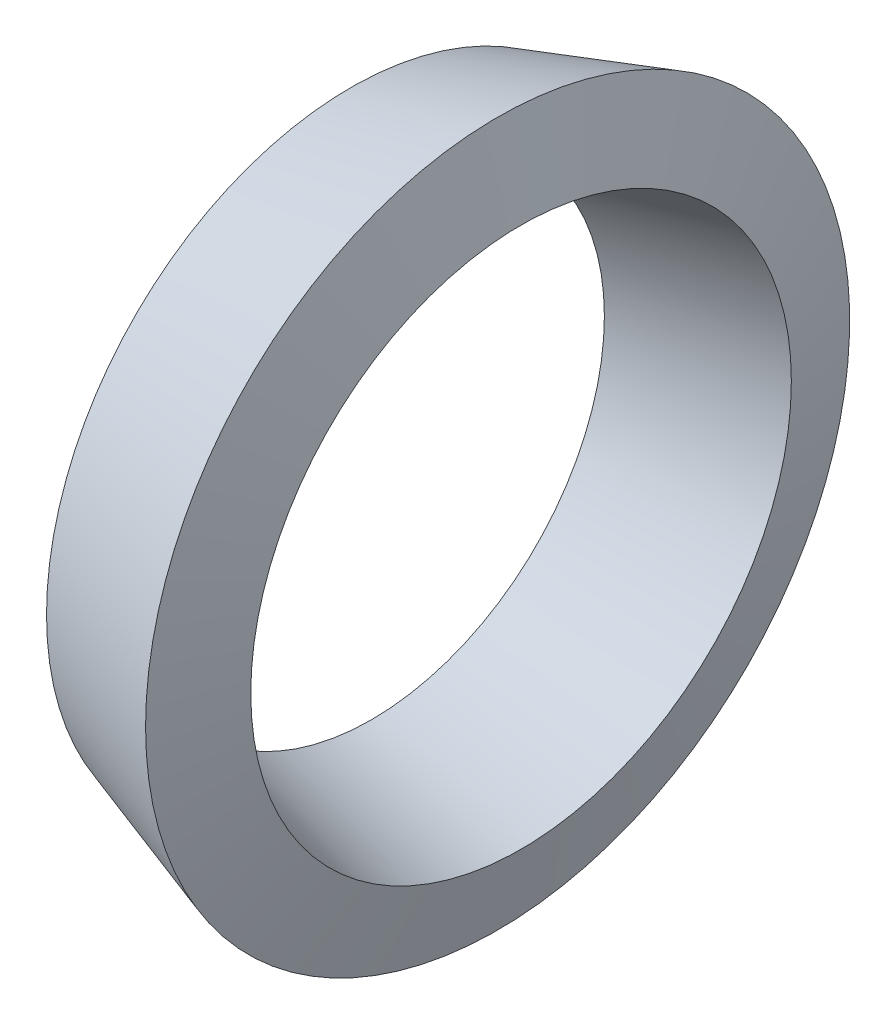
ISO-10303-21;
HEADER;
FILE_DESCRIPTION(('STEP AP214'),'2;1');
FILE_NAME('part.step','',(''),(''),'','','');
FILE_SCHEMA(('AUTOMOTIVE_DESIGN { 1 0 10303 214 1 1 1 1 }'));
ENDSEC;
DATA;
#1=APPLICATION_CONTEXT('core data for automotive mechanical design processes');
#2=APPLICATION_PROTOCOL_DEFINITION('international standard','automotive_design',2000,#1);
#3=PRODUCT_CONTEXT('',#1,'mechanical');
#4=PRODUCT('Part','Part','',(#3));
#5=PRODUCT_RELATED_PRODUCT_CATEGORY('part','',(#4));
#6=PRODUCT_DEFINITION_FORMATION('','',#4);
#7=PRODUCT_DEFINITION_CONTEXT('part definition',#1,'design');
#8=PRODUCT_DEFINITION('design','',#6,#7);
#9=PRODUCT_DEFINITION_SHAPE('','',#8);
#10=(LENGTH_UNIT() NAMED_UNIT(*) SI_UNIT(.MILLI.,.METRE.));
#11=(NAMED_UNIT(*) PLANE_ANGLE_UNIT() SI_UNIT($,.RADIAN.));
#12=(NAMED_UNIT(*) SI_UNIT($,.STERADIAN.) SOLID_ANGLE_UNIT());
#13=UNCERTAINTY_MEASURE_WITH_UNIT(LENGTH_MEASURE(1.E-05),#10,'distance_accuracy_value','');
#14=(GEOMETRIC_REPRESENTATION_CONTEXT(3) GLOBAL_UNCERTAINTY_ASSIGNED_CONTEXT((#13)) GLOBAL_UNIT_ASSIGNED_CONTEXT((#10,
#11,#12)) REPRESENTATION_CONTEXT('',''));
#15=CARTESIAN_POINT('',(0.,0.,0.));
#16=DIRECTION('',(0.,0.,1.));
#17=DIRECTION('',(1.,0.,0.));
#18=AXIS2_PLACEMENT_3D('',#15,#16,#17);
#19=CARTESIAN_POINT('',(0.60459968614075,0.,0.));
#20=DIRECTION('',(1.,0.,0.));
#21=DIRECTION('',(0.,0.,-1.));
#22=AXIS2_PLACEMENT_3D('',#19,#20,#21);
#23=CONICAL_SURFACE('',#22,18.8978460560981,0.314086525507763);
#24=CARTESIAN_POINT('',(9.71250197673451,0.,0.));
#25=DIRECTION('',(-1.,0.,0.));
#26=DIRECTION('',(0.,0.,1.));
#27=AXIS2_PLACEMENT_3D('',#24,#25,#26);
#28=CIRCLE('',#27,21.8564504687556);
#29=CARTESIAN_POINT('',(9.71250197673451,0.,21.8564504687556));
#30=VERTEX_POINT('',#29);
#31=EDGE_CURVE('E9',#30,#30,#28,.T.);
#32=ORIENTED_EDGE('',*,*,#31,.T.);
#33=EDGE_LOOP('',(#32));
#34=FACE_BOUND('',#33,.T.);
#35=CARTESIAN_POINT('',(0.60459968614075,0.,0.));
#36=DIRECTION('',(-1.,0.,0.));
#37=DIRECTION('',(0.,0.,1.));
#38=AXIS2_PLACEMENT_3D('',#35,#36,#37);
#39=CIRCLE('',#38,18.8978460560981);
#40=CARTESIAN_POINT('',(0.60459968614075,0.,18.8978460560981));
#41=VERTEX_POINT('',#40);
#42=EDGE_CURVE('E28',#41,#41,#39,.T.);
#43=ORIENTED_EDGE('',*,*,#42,.F.);
#44=EDGE_LOOP('',(#43));
#45=FACE_BOUND('',#44,.T.);
#46=ADVANCED_FACE('F14',(#34,#45),#23,.T.);
#47=CARTESIAN_POINT('',(11.1674980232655,0.,0.));
#48=DIRECTION('',(-1.,0.,0.));
#49=DIRECTION('',(0.,0.,1.));
#50=AXIS2_PLACEMENT_3D('',#47,#48,#49);
#51=CONICAL_SURFACE('',#50,16.7808828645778,1.29161638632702);
#52=ORIENTED_EDGE('',*,*,#31,.F.);
#53=EDGE_LOOP('',(#52));
#54=FACE_BOUND('',#53,.T.);
#55=CARTESIAN_POINT('',(11.1674980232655,0.,0.));
#56=DIRECTION('',(-1.,0.,0.));
#57=DIRECTION('',(0.,0.,1.));
#58=AXIS2_PLACEMENT_3D('',#55,#56,#57);
#59=CIRCLE('',#58,16.7808828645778);
#60=CARTESIAN_POINT('',(11.1674980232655,0.,16.7808828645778));
#61=VERTEX_POINT('',#60);
#62=EDGE_CURVE('E20',#61,#61,#59,.T.);
#63=ORIENTED_EDGE('',*,*,#62,.T.);
#64=EDGE_LOOP('',(#63));
#65=FACE_BOUND('',#64,.T.);
#66=ADVANCED_FACE('F37',(#54,#65),#51,.T.);
#67=CARTESIAN_POINT('',(1.87540031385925,0.,0.));
#68=DIRECTION('',(1.,0.,0.));
#69=DIRECTION('',(0.,0.,-1.));
#70=AXIS2_PLACEMENT_3D('',#67,#68,#69);
#71=CONICAL_SURFACE('',#70,14.4648206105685,0.24427335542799);
#72=ORIENTED_EDGE('',*,*,#62,.F.);
#73=EDGE_LOOP('',(#72));
#74=FACE_BOUND('',#73,.T.);
#75=CARTESIAN_POINT('',(1.87540031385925,0.,0.));
#76=DIRECTION('',(-1.,0.,0.));
#77=DIRECTION('',(0.,0.,1.));
#78=AXIS2_PLACEMENT_3D('',#75,#76,#77);
#79=CIRCLE('',#78,14.4648206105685);
#80=CARTESIAN_POINT('',(1.87540031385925,0.,14.4648206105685));
#81=VERTEX_POINT('',#80);
#82=EDGE_CURVE('E24',#81,#81,#79,.T.);
#83=ORIENTED_EDGE('',*,*,#82,.T.);
#84=EDGE_LOOP('',(#83));
#85=FACE_BOUND('',#84,.T.);
#86=ADVANCED_FACE('F42',(#74,#85),#71,.F.);
#87=CARTESIAN_POINT('',(0.60459968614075,0.,0.));
#88=DIRECTION('',(-1.,0.,0.));
#89=DIRECTION('',(0.,0.,1.));
#90=AXIS2_PLACEMENT_3D('',#87,#88,#89);
#91=CONICAL_SURFACE('',#90,18.8978460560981,1.29161638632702);
#92=ORIENTED_EDGE('',*,*,#82,.F.);
#93=EDGE_LOOP('',(#92));
#94=FACE_BOUND('',#93,.T.);
#95=ORIENTED_EDGE('',*,*,#42,.T.);
#96=EDGE_LOOP('',(#95));
#97=FACE_BOUND('',#96,.T.);
#98=ADVANCED_FACE('F34',(#94,#97),#91,.F.);
#99=CLOSED_SHELL('',(#46,#66,#86,#98));
#100=MANIFOLD_SOLID_BREP('B1',#99);
#101=ADVANCED_BREP_SHAPE_REPRESENTATION('',(#18,#100),#14);
#102=SHAPE_DEFINITION_REPRESENTATION(#9,#101);
ENDSEC;
END-ISO-10303-21;
